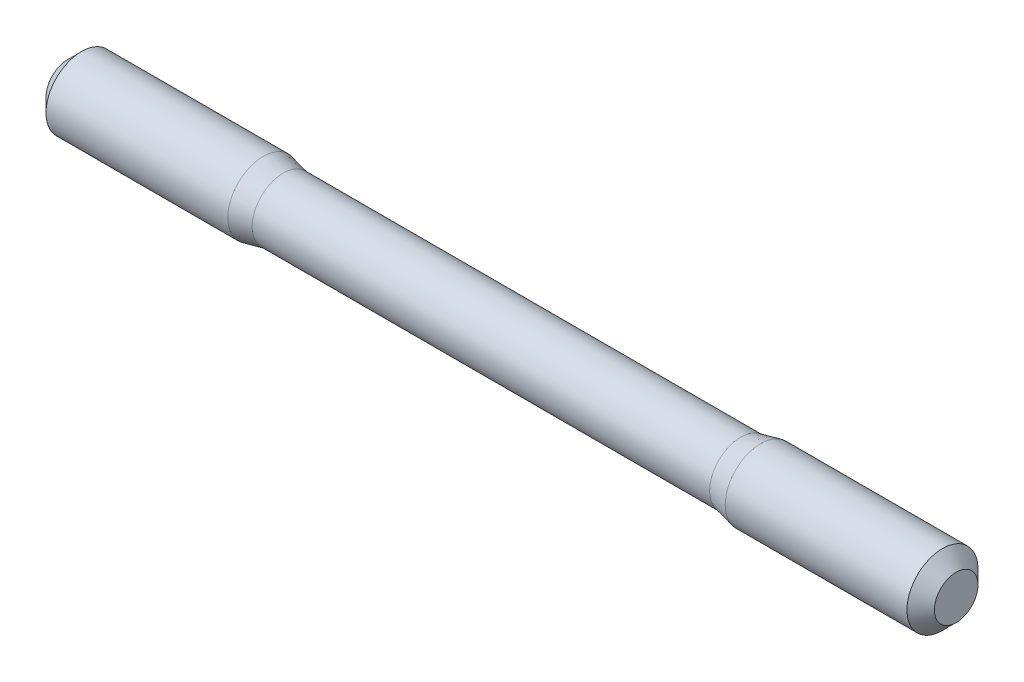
ISO-10303-21;
HEADER;
FILE_DESCRIPTION(('STEP AP214'),'2;1');
FILE_NAME('part.step','',(''),(''),'','','');
FILE_SCHEMA(('AUTOMOTIVE_DESIGN { 1 0 10303 214 1 1 1 1 }'));
ENDSEC;
DATA;
#1=APPLICATION_CONTEXT('core data for automotive mechanical design processes');
#2=APPLICATION_PROTOCOL_DEFINITION('international standard','automotive_design',2000,#1);
#3=PRODUCT_CONTEXT('',#1,'mechanical');
#4=PRODUCT('Part','Part','',(#3));
#5=PRODUCT_RELATED_PRODUCT_CATEGORY('part','',(#4));
#6=PRODUCT_DEFINITION_FORMATION('','',#4);
#7=PRODUCT_DEFINITION_CONTEXT('part definition',#1,'design');
#8=PRODUCT_DEFINITION('design','',#6,#7);
#9=PRODUCT_DEFINITION_SHAPE('','',#8);
#10=(LENGTH_UNIT() NAMED_UNIT(*) SI_UNIT(.MILLI.,.METRE.));
#11=(NAMED_UNIT(*) PLANE_ANGLE_UNIT() SI_UNIT($,.RADIAN.));
#12=(NAMED_UNIT(*) SI_UNIT($,.STERADIAN.) SOLID_ANGLE_UNIT());
#13=UNCERTAINTY_MEASURE_WITH_UNIT(LENGTH_MEASURE(1.E-05),#10,'distance_accuracy_value','');
#14=(GEOMETRIC_REPRESENTATION_CONTEXT(3) GLOBAL_UNCERTAINTY_ASSIGNED_CONTEXT((#13)) GLOBAL_UNIT_ASSIGNED_CONTEXT((#10,
#11,#12)) REPRESENTATION_CONTEXT('',''));
#15=CARTESIAN_POINT('',(0.,0.,0.));
#16=DIRECTION('',(0.,0.,1.));
#17=DIRECTION('',(1.,0.,0.));
#18=AXIS2_PLACEMENT_3D('',#15,#16,#17);
#19=CARTESIAN_POINT('',(0.,0.,0.));
#20=DIRECTION('',(1.,0.,0.));
#21=DIRECTION('',(0.,0.,-1.));
#22=AXIS2_PLACEMENT_3D('',#19,#20,#21);
#23=PLANE('',#22);
#24=CARTESIAN_POINT('',(0.,0.,0.));
#25=DIRECTION('',(1.,0.,0.));
#26=DIRECTION('',(0.,0.,-1.));
#27=AXIS2_PLACEMENT_3D('',#24,#25,#26);
#28=CIRCLE('',#27,2.45849999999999);
#29=CARTESIAN_POINT('',(0.,0.,-2.45849999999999));
#30=VERTEX_POINT('',#29);
#31=EDGE_CURVE('E58',#30,#30,#28,.F.);
#32=ORIENTED_EDGE('',*,*,#31,.T.);
#33=EDGE_LOOP('',(#32));
#34=FACE_BOUND('',#33,.T.);
#35=ADVANCED_FACE('F43',(#34),#23,.F.);
#36=CARTESIAN_POINT('',(-1.31084166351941,0.,0.));
#37=DIRECTION('',(-1.,0.,0.));
#38=DIRECTION('',(0.,0.,1.));
#39=AXIS2_PLACEMENT_3D('',#36,#37,#38);
#40=CYLINDRICAL_SURFACE('',#39,4.);
#41=CARTESIAN_POINT('',(1.54150000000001,0.,0.));
#42=DIRECTION('',(1.,0.,0.));
#43=DIRECTION('',(0.,0.,-1.));
#44=AXIS2_PLACEMENT_3D('',#41,#42,#43);
#45=CIRCLE('',#44,4.);
#46=CARTESIAN_POINT('',(1.54150000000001,0.,-4.));
#47=VERTEX_POINT('',#46);
#48=EDGE_CURVE('E54',#47,#47,#45,.T.);
#49=ORIENTED_EDGE('',*,*,#48,.T.);
#50=EDGE_LOOP('',(#49));
#51=FACE_BOUND('',#50,.T.);
#52=CARTESIAN_POINT('',(22.,0.,0.));
#53=DIRECTION('',(-1.,0.,0.));
#54=DIRECTION('',(0.,0.,1.));
#55=AXIS2_PLACEMENT_3D('',#52,#53,#54);
#56=CIRCLE('',#55,4.);
#57=CARTESIAN_POINT('',(22.,0.,4.));
#58=VERTEX_POINT('',#57);
#59=EDGE_CURVE('E63',#58,#58,#56,.T.);
#60=ORIENTED_EDGE('',*,*,#59,.T.);
#61=EDGE_LOOP('',(#60));
#62=FACE_BOUND('',#61,.T.);
#63=ADVANCED_FACE('F92',(#51,#62),#40,.T.);
#64=CARTESIAN_POINT('',(24.25,0.,0.));
#65=DIRECTION('',(-1.,0.,0.));
#66=DIRECTION('',(0.,0.,1.));
#67=AXIS2_PLACEMENT_3D('',#64,#65,#66);
#68=CONICAL_SURFACE('',#67,3.5,0.218668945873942);
#69=ORIENTED_EDGE('',*,*,#59,.F.);
#70=EDGE_LOOP('',(#69));
#71=FACE_BOUND('',#70,.T.);
#72=CARTESIAN_POINT('',(24.25,0.,0.));
#73=DIRECTION('',(-1.,0.,0.));
#74=DIRECTION('',(0.,0.,1.));
#75=AXIS2_PLACEMENT_3D('',#72,#73,#74);
#76=CIRCLE('',#75,3.5);
#77=CARTESIAN_POINT('',(24.25,0.,3.5));
#78=VERTEX_POINT('',#77);
#79=EDGE_CURVE('E66',#78,#78,#76,.T.);
#80=ORIENTED_EDGE('',*,*,#79,.T.);
#81=EDGE_LOOP('',(#80));
#82=FACE_BOUND('',#81,.T.);
#83=ADVANCED_FACE('F99',(#71,#82),#68,.T.);
#84=CARTESIAN_POINT('',(-1.31084166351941,0.,0.));
#85=DIRECTION('',(-1.,0.,0.));
#86=DIRECTION('',(0.,0.,1.));
#87=AXIS2_PLACEMENT_3D('',#84,#85,#86);
#88=CYLINDRICAL_SURFACE('',#87,3.5);
#89=ORIENTED_EDGE('',*,*,#79,.F.);
#90=EDGE_LOOP('',(#89));
#91=FACE_BOUND('',#90,.T.);
#92=CARTESIAN_POINT('',(75.75,0.,0.));
#93=DIRECTION('',(-1.,0.,0.));
#94=DIRECTION('',(0.,0.,1.));
#95=AXIS2_PLACEMENT_3D('',#92,#93,#94);
#96=CIRCLE('',#95,3.5);
#97=CARTESIAN_POINT('',(75.75,0.,3.5));
#98=VERTEX_POINT('',#97);
#99=EDGE_CURVE('E69',#98,#98,#96,.T.);
#100=ORIENTED_EDGE('',*,*,#99,.T.);
#101=EDGE_LOOP('',(#100));
#102=FACE_BOUND('',#101,.T.);
#103=ADVANCED_FACE('F88',(#91,#102),#88,.T.);
#104=CARTESIAN_POINT('',(78.,0.,0.));
#105=DIRECTION('',(1.,0.,0.));
#106=DIRECTION('',(0.,0.,-1.));
#107=AXIS2_PLACEMENT_3D('',#104,#105,#106);
#108=CONICAL_SURFACE('',#107,4.,0.218668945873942);
#109=ORIENTED_EDGE('',*,*,#99,.F.);
#110=EDGE_LOOP('',(#109));
#111=FACE_BOUND('',#110,.T.);
#112=CARTESIAN_POINT('',(78.,0.,0.));
#113=DIRECTION('',(-1.,0.,0.));
#114=DIRECTION('',(0.,0.,1.));
#115=AXIS2_PLACEMENT_3D('',#112,#113,#114);
#116=CIRCLE('',#115,4.);
#117=CARTESIAN_POINT('',(78.,0.,4.));
#118=VERTEX_POINT('',#117);
#119=EDGE_CURVE('E72',#118,#118,#116,.T.);
#120=ORIENTED_EDGE('',*,*,#119,.T.);
#121=EDGE_LOOP('',(#120));
#122=FACE_BOUND('',#121,.T.);
#123=ADVANCED_FACE('F76',(#111,#122),#108,.T.);
#124=CARTESIAN_POINT('',(-1.31084166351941,0.,0.));
#125=DIRECTION('',(-1.,0.,0.));
#126=DIRECTION('',(0.,0.,1.));
#127=AXIS2_PLACEMENT_3D('',#124,#125,#126);
#128=CYLINDRICAL_SURFACE('',#127,4.);
#129=CARTESIAN_POINT('',(98.4585,0.,0.));
#130=DIRECTION('',(-1.,0.,0.));
#131=DIRECTION('',(0.,0.,1.));
#132=AXIS2_PLACEMENT_3D('',#129,#130,#131);
#133=CIRCLE('',#132,4.);
#134=CARTESIAN_POINT('',(98.4585,0.,4.));
#135=VERTEX_POINT('',#134);
#136=EDGE_CURVE('E50',#135,#135,#133,.T.);
#137=ORIENTED_EDGE('',*,*,#136,.T.);
#138=EDGE_LOOP('',(#137));
#139=FACE_BOUND('',#138,.T.);
#140=ORIENTED_EDGE('',*,*,#119,.F.);
#141=EDGE_LOOP('',(#140));
#142=FACE_BOUND('',#141,.T.);
#143=ADVANCED_FACE('F78',(#139,#142),#128,.T.);
#144=CARTESIAN_POINT('',(100.,4.,0.));
#145=DIRECTION('',(-1.,0.,0.));
#146=DIRECTION('',(0.,0.,1.));
#147=AXIS2_PLACEMENT_3D('',#144,#145,#146);
#148=PLANE('',#147);
#149=CARTESIAN_POINT('',(100.,0.,0.));
#150=DIRECTION('',(-1.,0.,0.));
#151=DIRECTION('',(0.,0.,1.));
#152=AXIS2_PLACEMENT_3D('',#149,#150,#151);
#153=CIRCLE('',#152,2.45850000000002);
#154=CARTESIAN_POINT('',(100.,0.,2.45850000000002));
#155=VERTEX_POINT('',#154);
#156=EDGE_CURVE('E10',#155,#155,#153,.F.);
#157=ORIENTED_EDGE('',*,*,#156,.T.);
#158=EDGE_LOOP('',(#157));
#159=FACE_BOUND('',#158,.T.);
#160=ADVANCED_FACE('F80',(#159),#148,.F.);
#161=CARTESIAN_POINT('',(0.,0.,0.));
#162=DIRECTION('',(1.,0.,0.));
#163=DIRECTION('',(0.,0.,-1.));
#164=AXIS2_PLACEMENT_3D('',#161,#162,#163);
#165=CONICAL_SURFACE('',#164,2.45849999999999,0.785398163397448);
#166=ORIENTED_EDGE('',*,*,#48,.F.);
#167=EDGE_LOOP('',(#166));
#168=FACE_BOUND('',#167,.T.);
#169=ORIENTED_EDGE('',*,*,#31,.F.);
#170=EDGE_LOOP('',(#169));
#171=FACE_BOUND('',#170,.T.);
#172=ADVANCED_FACE('F85',(#168,#171),#165,.T.);
#173=CARTESIAN_POINT('',(98.4585,0.,0.));
#174=DIRECTION('',(-1.,0.,0.));
#175=DIRECTION('',(0.,0.,1.));
#176=AXIS2_PLACEMENT_3D('',#173,#174,#175);
#177=CONICAL_SURFACE('',#176,4.,0.785398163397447);
#178=ORIENTED_EDGE('',*,*,#156,.F.);
#179=EDGE_LOOP('',(#178));
#180=FACE_BOUND('',#179,.T.);
#181=ORIENTED_EDGE('',*,*,#136,.F.);
#182=EDGE_LOOP('',(#181));
#183=FACE_BOUND('',#182,.T.);
#184=ADVANCED_FACE('F45',(#180,#183),#177,.T.);
#185=CLOSED_SHELL('',(#35,#63,#83,#103,#123,#143,#160,#172,#184));
#186=MANIFOLD_SOLID_BREP('B2',#185);
#187=ADVANCED_BREP_SHAPE_REPRESENTATION('',(#18,#186),#14);
#188=SHAPE_DEFINITION_REPRESENTATION(#9,#187);
ENDSEC;
END-ISO-10303-21;
